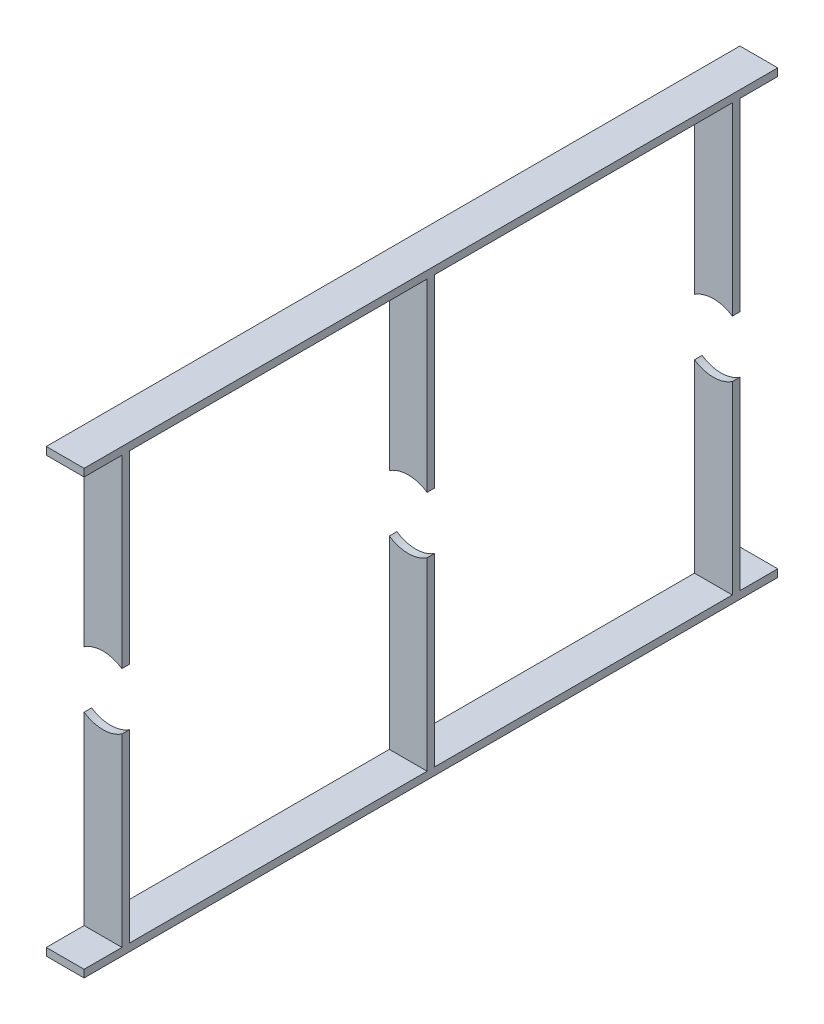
from build123d import *

# Parameters (mm, degrees)
SKETCH3_W           = 60
SKETCH3_H           = 12
BOSS_EXTRUDE3_DEPTH = 676
SKETCH1_R           = 54
CUT_EXTRUDE1_DEPTH  = 500
SKETCH4_W           = 60
SKETCH4_H           = 1100
BOSS_EXTRUDE4_DEPTH = 12
LPATTERN1_COUNT     = 3
LPATTERN1_PITCH     = 484
LPATTERN1_2_COUNT   = 3
LPATTERN1_2_PITCH   = 484
LPATTERN2_COUNT     = 2
LPATTERN2_PITCH     = 688


with BuildPart() as part:
    # Sketch3 → Boss-Extrude3 (new body)
    with BuildSketch(Plane(origin=(0, 338, 0), x_dir=(1, 0, 0), z_dir=(0, 1, 0))):
        with Locations((0, -484)):
            Rectangle(SKETCH3_W, SKETCH3_H)
    boss_extrude3 = extrude(amount=-BOSS_EXTRUDE3_DEPTH)

    # Sketch1 → Cut-Extrude1 (cut, symmetric)
    with BuildSketch(Plane.XY.offset(490)):
        Circle(SKETCH1_R)
    cut_extrude1 = extrude(amount=CUT_EXTRUDE1_DEPTH, both=True, mode=Mode.SUBTRACT)


with BuildPart() as cut_extrude1_piece_1:
    # of the separate pieces the step leaves, piece 1, a body of its own (cut_extrude1_pieces)
    add(part.part.solids().sort_by_distance((-30, -44.899888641, 490))[0])


with BuildPart() as cut_extrude1_piece_2:
    # of the separate pieces the step leaves, piece 2, a body of its own (cut_extrude1_pieces)
    add(part.part.solids().sort_by_distance((30, 338, 490))[0])

    # Sketch4 → Boss-Extrude4 (add)
    with BuildSketch(Plane(origin=(0, 338, 0), x_dir=(1, 0, 0), z_dir=(0, 1, 0))):
        Rectangle(SKETCH4_W, SKETCH4_H)
    boss_extrude4 = extrude(amount=BOSS_EXTRUDE4_DEPTH)

    # LPattern1: Boss-Extrude3 ×3
    with Locations(*[(0, 0, -i * LPATTERN1_PITCH) for i in range(1, LPATTERN1_COUNT)]):
        add(boss_extrude3)

    # LPattern1 2: Cut-Extrude1 ×3
    with Locations(*[(0, 0, -i * LPATTERN1_2_PITCH) for i in range(1, LPATTERN1_2_COUNT)]):
        add(cut_extrude1, mode=Mode.SUBTRACT)


with BuildPart() as cut_extrude1_piece_1_1:
    add(cut_extrude1_piece_1.part)

    add(cut_extrude1_piece_2.part)  # LPattern2 merges Cut-Extrude1 piece 2
    # LPattern2: Boss-Extrude4 ×2
    with Locations(*[(0, -i * LPATTERN2_PITCH, 0) for i in range(1, LPATTERN2_COUNT)]):
        add(boss_extrude4)


solid = cut_extrude1_piece_1_1.part
